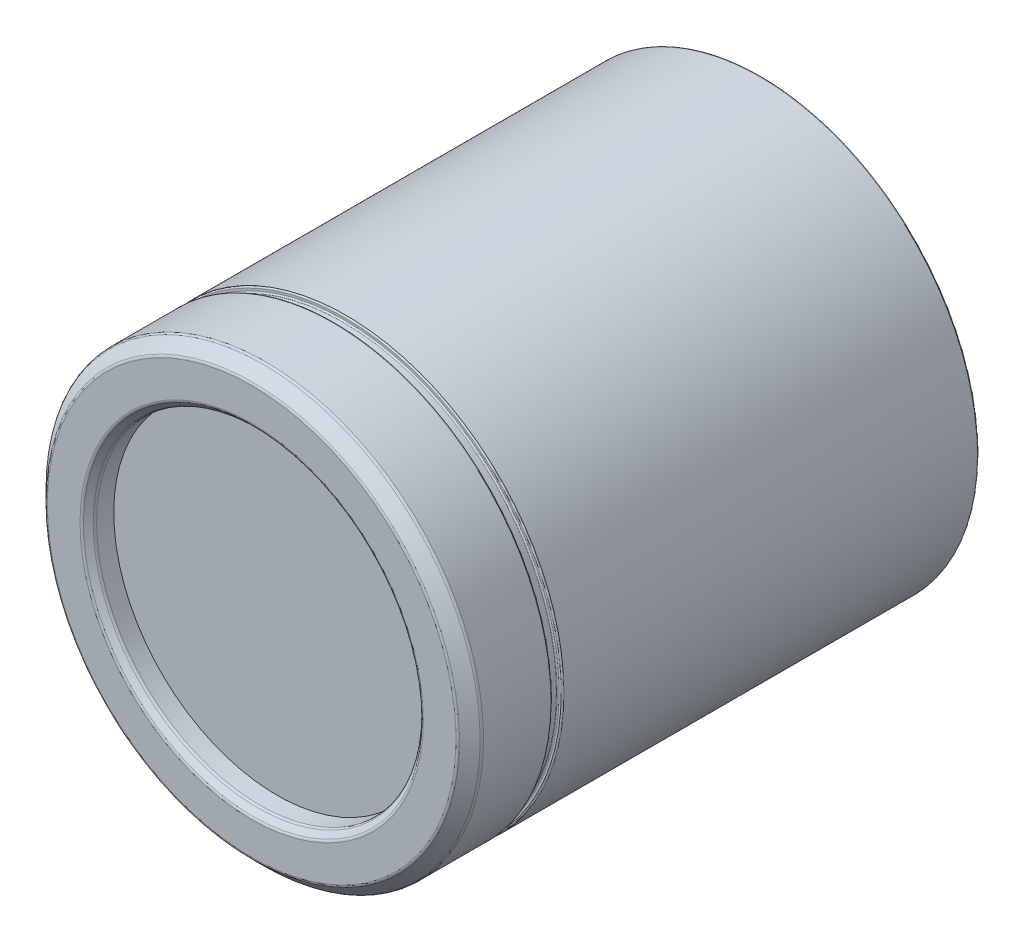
ISO-10303-21;
HEADER;
FILE_DESCRIPTION(('STEP AP214'),'2;1');
FILE_NAME('part.step','',(''),(''),'','','');
FILE_SCHEMA(('AUTOMOTIVE_DESIGN { 1 0 10303 214 1 1 1 1 }'));
ENDSEC;
DATA;
#1=APPLICATION_CONTEXT('core data for automotive mechanical design processes');
#2=APPLICATION_PROTOCOL_DEFINITION('international standard','automotive_design',2000,#1);
#3=PRODUCT_CONTEXT('',#1,'mechanical');
#4=PRODUCT('Part','Part','',(#3));
#5=PRODUCT_RELATED_PRODUCT_CATEGORY('part','',(#4));
#6=PRODUCT_DEFINITION_FORMATION('','',#4);
#7=PRODUCT_DEFINITION_CONTEXT('part definition',#1,'design');
#8=PRODUCT_DEFINITION('design','',#6,#7);
#9=PRODUCT_DEFINITION_SHAPE('','',#8);
#10=(LENGTH_UNIT() NAMED_UNIT(*) SI_UNIT(.MILLI.,.METRE.));
#11=(NAMED_UNIT(*) PLANE_ANGLE_UNIT() SI_UNIT($,.RADIAN.));
#12=(NAMED_UNIT(*) SI_UNIT($,.STERADIAN.) SOLID_ANGLE_UNIT());
#13=UNCERTAINTY_MEASURE_WITH_UNIT(LENGTH_MEASURE(1.E-05),#10,'distance_accuracy_value','');
#14=(GEOMETRIC_REPRESENTATION_CONTEXT(3) GLOBAL_UNCERTAINTY_ASSIGNED_CONTEXT((#13)) GLOBAL_UNIT_ASSIGNED_CONTEXT((#10,
#11,#12)) REPRESENTATION_CONTEXT('',''));
#15=CARTESIAN_POINT('',(0.,0.,0.));
#16=DIRECTION('',(0.,0.,1.));
#17=DIRECTION('',(1.,0.,0.));
#18=AXIS2_PLACEMENT_3D('',#15,#16,#17);
#19=CARTESIAN_POINT('',(0.,0.,70.3));
#20=DIRECTION('',(0.,0.,1.));
#21=DIRECTION('',(1.,0.,0.));
#22=AXIS2_PLACEMENT_3D('',#19,#20,#21);
#23=PLANE('',#22);
#24=CARTESIAN_POINT('',(0.,0.,70.3));
#25=DIRECTION('',(0.,0.,1.));
#26=DIRECTION('',(1.,0.,0.));
#27=AXIS2_PLACEMENT_3D('',#24,#25,#26);
#28=CIRCLE('',#27,23.75);
#29=CARTESIAN_POINT('',(23.75,0.,70.3));
#30=VERTEX_POINT('',#29);
#31=EDGE_CURVE('E21',#30,#30,#28,.T.);
#32=ORIENTED_EDGE('',*,*,#31,.T.);
#33=EDGE_LOOP('',(#32));
#34=FACE_BOUND('',#33,.T.);
#35=ADVANCED_FACE('F17',(#34),#23,.T.);
#36=CARTESIAN_POINT('',(0.,0.,0.));
#37=DIRECTION('',(0.,0.,1.));
#38=DIRECTION('',(1.,0.,0.));
#39=AXIS2_PLACEMENT_3D('',#36,#37,#38);
#40=CYLINDRICAL_SURFACE('',#39,23.75);
#41=ORIENTED_EDGE('',*,*,#31,.F.);
#42=EDGE_LOOP('',(#41));
#43=FACE_BOUND('',#42,.T.);
#44=CARTESIAN_POINT('',(0.,0.,72.7928932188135));
#45=DIRECTION('',(0.,0.,-1.));
#46=DIRECTION('',(-1.,0.,0.));
#47=AXIS2_PLACEMENT_3D('',#44,#45,#46);
#48=CIRCLE('',#47,23.75);
#49=CARTESIAN_POINT('',(-23.75,0.,72.7928932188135));
#50=VERTEX_POINT('',#49);
#51=EDGE_CURVE('E133',#50,#50,#48,.T.);
#52=ORIENTED_EDGE('',*,*,#51,.F.);
#53=EDGE_LOOP('',(#52));
#54=FACE_BOUND('',#53,.T.);
#55=ADVANCED_FACE('F642',(#43,#54),#40,.F.);
#56=CARTESIAN_POINT('',(0.,0.,72.7928932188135));
#57=DIRECTION('',(0.,0.,-1.));
#58=DIRECTION('',(-1.,0.,0.));
#59=AXIS2_PLACEMENT_3D('',#56,#57,#58);
#60=TOROIDAL_SURFACE('',#59,24.25,0.499999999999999);
#61=CARTESIAN_POINT('',(0.,0.,73.1464466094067));
#62=DIRECTION('',(0.,0.,1.));
#63=DIRECTION('',(1.,0.,0.));
#64=AXIS2_PLACEMENT_3D('',#61,#62,#63);
#65=CIRCLE('',#64,23.8964466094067);
#66=CARTESIAN_POINT('',(23.8964466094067,0.,73.1464466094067));
#67=VERTEX_POINT('',#66);
#68=EDGE_CURVE('E130',#67,#67,#65,.T.);
#69=ORIENTED_EDGE('',*,*,#68,.T.);
#70=EDGE_LOOP('',(#69));
#71=FACE_BOUND('',#70,.T.);
#72=ORIENTED_EDGE('',*,*,#51,.T.);
#73=EDGE_LOOP('',(#72));
#74=FACE_BOUND('',#73,.T.);
#75=ADVANCED_FACE('F359',(#71,#74),#60,.T.);
#76=CARTESIAN_POINT('',(0.,0.,73.8535533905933));
#77=DIRECTION('',(0.,0.,1.));
#78=DIRECTION('',(1.,0.,0.));
#79=AXIS2_PLACEMENT_3D('',#76,#77,#78);
#80=CONICAL_SURFACE('',#79,24.6035533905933,0.785398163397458);
#81=ORIENTED_EDGE('',*,*,#68,.F.);
#82=EDGE_LOOP('',(#81));
#83=FACE_BOUND('',#82,.T.);
#84=CARTESIAN_POINT('',(0.,0.,73.8535533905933));
#85=DIRECTION('',(0.,0.,-1.));
#86=DIRECTION('',(1.,0.,0.));
#87=AXIS2_PLACEMENT_3D('',#84,#85,#86);
#88=CIRCLE('',#87,24.6035533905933);
#89=CARTESIAN_POINT('',(24.6035533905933,0.,73.8535533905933));
#90=VERTEX_POINT('',#89);
#91=EDGE_CURVE('E126',#90,#90,#88,.T.);
#92=ORIENTED_EDGE('',*,*,#91,.F.);
#93=EDGE_LOOP('',(#92));
#94=FACE_BOUND('',#93,.T.);
#95=ADVANCED_FACE('F350',(#83,#94),#80,.F.);
#96=CARTESIAN_POINT('',(0.,0.,73.5000000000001));
#97=DIRECTION('',(0.,0.,1.));
#98=DIRECTION('',(0.,-1.,0.));
#99=AXIS2_PLACEMENT_3D('',#96,#97,#98);
#100=TOROIDAL_SURFACE('',#99,24.9571067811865,0.499999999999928);
#101=ORIENTED_EDGE('',*,*,#91,.T.);
#102=EDGE_LOOP('',(#101));
#103=FACE_BOUND('',#102,.T.);
#104=CARTESIAN_POINT('',(0.,0.,74.));
#105=DIRECTION('',(0.,0.,1.));
#106=DIRECTION('',(0.,-1.,0.));
#107=AXIS2_PLACEMENT_3D('',#104,#105,#106);
#108=CIRCLE('',#107,24.9571067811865);
#109=CARTESIAN_POINT('',(0.,-24.9571067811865,74.));
#110=VERTEX_POINT('',#109);
#111=EDGE_CURVE('E129',#110,#110,#108,.F.);
#112=ORIENTED_EDGE('',*,*,#111,.F.);
#113=EDGE_LOOP('',(#112));
#114=FACE_BOUND('',#113,.T.);
#115=ADVANCED_FACE('F347',(#103,#114),#100,.T.);
#116=CARTESIAN_POINT('',(0.,0.,68.3));
#117=DIRECTION('',(0.,0.,1.));
#118=DIRECTION('',(1.,0.,0.));
#119=AXIS2_PLACEMENT_3D('',#116,#117,#118);
#120=PLANE('',#119);
#121=CARTESIAN_POINT('',(0.,0.,68.3));
#122=DIRECTION('',(0.,0.,-1.));
#123=DIRECTION('',(-1.,0.,0.));
#124=AXIS2_PLACEMENT_3D('',#121,#122,#123);
#125=CIRCLE('',#124,24.75);
#126=CARTESIAN_POINT('',(-24.75,0.,68.3));
#127=VERTEX_POINT('',#126);
#128=EDGE_CURVE('E335',#127,#127,#125,.T.);
#129=ORIENTED_EDGE('',*,*,#128,.T.);
#130=EDGE_LOOP('',(#129));
#131=FACE_BOUND('',#130,.T.);
#132=ADVANCED_FACE('F349',(#131),#120,.F.);
#133=CARTESIAN_POINT('',(0.,0.,74.));
#134=DIRECTION('',(0.,0.,1.));
#135=DIRECTION('',(1.,0.,0.));
#136=AXIS2_PLACEMENT_3D('',#133,#134,#135);
#137=PLANE('',#136);
#138=ORIENTED_EDGE('',*,*,#111,.T.);
#139=EDGE_LOOP('',(#138));
#140=FACE_BOUND('',#139,.T.);
#141=CARTESIAN_POINT('',(0.,0.,74.));
#142=DIRECTION('',(0.,0.,1.));
#143=DIRECTION('',(0.,-1.,0.));
#144=AXIS2_PLACEMENT_3D('',#141,#142,#143);
#145=CIRCLE('',#144,29.6928932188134);
#146=CARTESIAN_POINT('',(0.,-29.6928932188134,74.));
#147=VERTEX_POINT('',#146);
#148=EDGE_CURVE('E332',#147,#147,#145,.F.);
#149=ORIENTED_EDGE('',*,*,#148,.F.);
#150=EDGE_LOOP('',(#149));
#151=FACE_BOUND('',#150,.T.);
#152=ADVANCED_FACE('F344',(#140,#151),#137,.T.);
#153=CARTESIAN_POINT('',(0.,0.,66.));
#154=DIRECTION('',(0.,0.,1.));
#155=DIRECTION('',(1.,0.,0.));
#156=AXIS2_PLACEMENT_3D('',#153,#154,#155);
#157=PLANE('',#156);
#158=CARTESIAN_POINT('',(-25.5,0.,65.9999999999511));
#159=DIRECTION('',(0.,0.,-1.));
#160=DIRECTION('',(-1.,0.,0.));
#161=AXIS2_PLACEMENT_3D('',#158,#159,#160);
#162=CIRCLE('',#161,0.551575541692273);
#163=CARTESIAN_POINT('',(-25.5,-0.551575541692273,65.9999999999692));
#164=VERTEX_POINT('',#163);
#165=CARTESIAN_POINT('',(-25.5,0.551575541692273,65.9999999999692));
#166=VERTEX_POINT('',#165);
#167=EDGE_CURVE('E96',#164,#166,#162,.T.);
#168=ORIENTED_EDGE('',*,*,#167,.T.);
#169=CARTESIAN_POINT('',(-25.5,0.,65.9999999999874));
#170=DIRECTION('',(0.,0.,-1.));
#171=DIRECTION('',(-1.,0.,0.));
#172=AXIS2_PLACEMENT_3D('',#169,#170,#171);
#173=CIRCLE('',#172,0.551575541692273);
#174=EDGE_CURVE('E62',#166,#164,#173,.T.);
#175=ORIENTED_EDGE('',*,*,#174,.T.);
#176=EDGE_LOOP('',(#168,#175));
#177=FACE_BOUND('',#176,.T.);
#178=ADVANCED_FACE('F602',(#177),#157,.F.);
#179=CARTESIAN_POINT('',(0.,0.,68.3));
#180=DIRECTION('',(0.,0.,-1.));
#181=DIRECTION('',(-1.,0.,0.));
#182=AXIS2_PLACEMENT_3D('',#179,#180,#181);
#183=CYLINDRICAL_SURFACE('',#182,24.75);
#184=CARTESIAN_POINT('',(0.,0.,67.3));
#185=DIRECTION('',(0.,0.,-1.));
#186=DIRECTION('',(-1.,0.,0.));
#187=AXIS2_PLACEMENT_3D('',#184,#185,#186);
#188=CIRCLE('',#187,24.75);
#189=CARTESIAN_POINT('',(-24.75,0.,67.3));
#190=VERTEX_POINT('',#189);
#191=EDGE_CURVE('E328',#190,#190,#188,.T.);
#192=ORIENTED_EDGE('',*,*,#191,.T.);
#193=EDGE_LOOP('',(#192));
#194=FACE_BOUND('',#193,.T.);
#195=ORIENTED_EDGE('',*,*,#128,.F.);
#196=EDGE_LOOP('',(#195));
#197=FACE_BOUND('',#196,.T.);
#198=ADVANCED_FACE('F593',(#194,#197),#183,.F.);
#199=CARTESIAN_POINT('',(0.,0.,66.));
#200=DIRECTION('',(0.,0.,1.));
#201=DIRECTION('',(1.,0.,0.));
#202=AXIS2_PLACEMENT_3D('',#199,#200,#201);
#203=PLANE('',#202);
#204=CARTESIAN_POINT('',(25.5,0.,65.9999999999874));
#205=DIRECTION('',(0.,0.,-1.));
#206=DIRECTION('',(-1.,0.,0.));
#207=AXIS2_PLACEMENT_3D('',#204,#205,#206);
#208=CIRCLE('',#207,0.551575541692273);
#209=CARTESIAN_POINT('',(25.5,-0.551575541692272,65.9999999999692));
#210=VERTEX_POINT('',#209);
#211=CARTESIAN_POINT('',(25.5,0.551575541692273,65.9999999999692));
#212=VERTEX_POINT('',#211);
#213=EDGE_CURVE('E105',#210,#212,#208,.T.);
#214=ORIENTED_EDGE('',*,*,#213,.T.);
#215=CARTESIAN_POINT('',(25.5,0.,65.9999999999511));
#216=DIRECTION('',(0.,0.,-1.));
#217=DIRECTION('',(-1.,0.,0.));
#218=AXIS2_PLACEMENT_3D('',#215,#216,#217);
#219=CIRCLE('',#218,0.551575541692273);
#220=EDGE_CURVE('E319',#212,#210,#219,.T.);
#221=ORIENTED_EDGE('',*,*,#220,.T.);
#222=EDGE_LOOP('',(#214,#221));
#223=FACE_BOUND('',#222,.T.);
#224=ADVANCED_FACE('F367',(#223),#203,.F.);
#225=CARTESIAN_POINT('',(0.,0.,73.5));
#226=DIRECTION('',(0.,0.,1.));
#227=DIRECTION('',(0.,-1.,0.));
#228=AXIS2_PLACEMENT_3D('',#225,#226,#227);
#229=TOROIDAL_SURFACE('',#228,29.6928932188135,0.499999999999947);
#230=ORIENTED_EDGE('',*,*,#148,.T.);
#231=EDGE_LOOP('',(#230));
#232=FACE_BOUND('',#231,.T.);
#233=CARTESIAN_POINT('',(0.,0.,73.8535533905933));
#234=DIRECTION('',(0.,0.,-1.));
#235=DIRECTION('',(-1.,0.,0.));
#236=AXIS2_PLACEMENT_3D('',#233,#234,#235);
#237=CIRCLE('',#236,30.0464466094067);
#238=CARTESIAN_POINT('',(-30.0464466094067,0.,73.8535533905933));
#239=VERTEX_POINT('',#238);
#240=EDGE_CURVE('E108',#239,#239,#237,.T.);
#241=ORIENTED_EDGE('',*,*,#240,.F.);
#242=EDGE_LOOP('',(#241));
#243=FACE_BOUND('',#242,.T.);
#244=ADVANCED_FACE('F365',(#232,#243),#229,.T.);
#245=CARTESIAN_POINT('',(-25.5,0.,65.3400000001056));
#246=DIRECTION('',(0.,0.,-1.));
#247=DIRECTION('',(-1.,0.,0.));
#248=AXIS2_PLACEMENT_3D('',#245,#246,#247);
#249=CONICAL_SURFACE('',#248,1.64999999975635,1.02974425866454);
#250=DIRECTION('',(0.,0.857167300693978,0.515038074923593));
#251=VECTOR('',#250,1.);
#252=CARTESIAN_POINT('',(-25.4999999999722,-499000.,-299763.117485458));
#253=LINE('',#252,#251);
#254=CARTESIAN_POINT('',(-25.5,-1.64999999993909,65.3400000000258));
#255=VERTEX_POINT('',#254);
#256=EDGE_CURVE('E91',#164,#255,#253,.F.);
#257=ORIENTED_EDGE('',*,*,#256,.T.);
#258=CARTESIAN_POINT('',(-25.5,0.,65.34));
#259=DIRECTION('',(0.,0.,-1.));
#260=DIRECTION('',(-1.,0.,0.));
#261=AXIS2_PLACEMENT_3D('',#258,#259,#260);
#262=CIRCLE('',#261,1.65);
#263=CARTESIAN_POINT('',(-25.5,1.64999999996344,65.339999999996));
#264=VERTEX_POINT('',#263);
#265=EDGE_CURVE('E95',#255,#264,#262,.T.);
#266=ORIENTED_EDGE('',*,*,#265,.T.);
#267=DIRECTION('',(0.,-0.857167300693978,0.515038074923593));
#268=VECTOR('',#267,1.);
#269=CARTESIAN_POINT('',(-25.5,499000.,-299763.117485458));
#270=LINE('',#269,#268);
#271=EDGE_CURVE('E122',#264,#166,#270,.T.);
#272=ORIENTED_EDGE('',*,*,#271,.T.);
#273=ORIENTED_EDGE('',*,*,#167,.F.);
#274=EDGE_LOOP('',(#257,#266,#272,#273));
#275=FACE_BOUND('',#274,.T.);
#276=ADVANCED_FACE('F93',(#275),#249,.F.);
#277=CARTESIAN_POINT('',(-25.5,0.,65.3400000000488));
#278=DIRECTION('',(0.,0.,-1.));
#279=DIRECTION('',(-1.,0.,0.));
#280=AXIS2_PLACEMENT_3D('',#277,#278,#279);
#281=CONICAL_SURFACE('',#280,1.64999999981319,1.02974425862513);
#282=ORIENTED_EDGE('',*,*,#174,.F.);
#283=ORIENTED_EDGE('',*,*,#271,.F.);
#284=CARTESIAN_POINT('',(-25.5,0.,65.3399999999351));
#285=DIRECTION('',(0.,0.,-1.));
#286=DIRECTION('',(0.,1.,0.));
#287=AXIS2_PLACEMENT_3D('',#284,#285,#286);
#288=CIRCLE('',#287,1.65000000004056);
#289=CARTESIAN_POINT('',(-24.4662254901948,1.28600554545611,65.3399999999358));
#290=VERTEX_POINT('',#289);
#291=EDGE_CURVE('E74',#290,#264,#288,.F.);
#292=ORIENTED_EDGE('',*,*,#291,.F.);
#293=CARTESIAN_POINT('',(-24.4662254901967,1.28600554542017,65.3399999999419));
#294=CARTESIAN_POINT('',(-24.4680216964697,1.25183126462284,65.356677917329));
#295=CARTESIAN_POINT('',(-24.4697513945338,1.21755952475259,65.3731629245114));
#296=CARTESIAN_POINT('',(-24.4730767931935,1.14878131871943,65.4056628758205));
#297=CARTESIAN_POINT('',(-24.4746724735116,1.11427481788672,65.4216777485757));
#298=CARTESIAN_POINT('',(-24.4792677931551,1.010096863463,65.4690023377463));
#299=CARTESIAN_POINT('',(-24.4820620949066,0.940025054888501,65.4994644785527));
#300=CARTESIAN_POINT('',(-24.4871502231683,0.796709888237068,65.5577904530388));
#301=CARTESIAN_POINT('',(-24.4894296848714,0.723431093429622,65.5855696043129));
#302=CARTESIAN_POINT('',(-24.4933614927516,0.575094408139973,65.6357934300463));
#303=CARTESIAN_POINT('',(-24.4950147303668,0.500039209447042,65.6582456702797));
#304=CARTESIAN_POINT('',(-24.4972073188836,0.373359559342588,65.6890734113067));
#305=CARTESIAN_POINT('',(-24.4979342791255,0.322281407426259,65.6996458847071));
#306=CARTESIAN_POINT('',(-24.4990715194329,0.219403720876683,65.7164397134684));
#307=CARTESIAN_POINT('',(-24.4994818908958,0.167604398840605,65.7226623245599));
#308=CARTESIAN_POINT('',(-24.4999696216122,0.0642401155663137,65.7300817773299));
#309=CARTESIAN_POINT('',(-24.500050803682,0.0126794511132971,65.7313363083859));
#310=CARTESIAN_POINT('',(-24.4998876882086,-0.0903183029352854,65.7288404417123));
#311=CARTESIAN_POINT('',(-24.4996433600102,-0.141755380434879,65.725089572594));
#312=CARTESIAN_POINT('',(-24.4987021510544,-0.261272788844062,65.7109393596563));
#313=CARTESIAN_POINT('',(-24.4978807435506,-0.329134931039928,65.698728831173));
#314=CARTESIAN_POINT('',(-24.4957096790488,-0.463391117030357,65.6678977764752));
#315=CARTESIAN_POINT('',(-24.494359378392,-0.529783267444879,65.6492694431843));
#316=CARTESIAN_POINT('',(-24.4911490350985,-0.661840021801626,65.6072304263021));
#317=CARTESIAN_POINT('',(-24.489283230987,-0.727487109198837,65.5837664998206));
#318=CARTESIAN_POINT('',(-24.4850761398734,-0.857481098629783,65.5336413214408));
#319=CARTESIAN_POINT('',(-24.4827350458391,-0.921828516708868,65.506981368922));
#320=CARTESIAN_POINT('',(-24.4781144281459,-1.03658575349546,65.4570650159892));
#321=CARTESIAN_POINT('',(-24.4759185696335,-1.08717746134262,65.4342137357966));
#322=CARTESIAN_POINT('',(-24.4712673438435,-1.18724370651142,65.3876932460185));
#323=CARTESIAN_POINT('',(-24.4688153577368,-1.2367243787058,65.3640369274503));
#324=CARTESIAN_POINT('',(-24.4662254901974,-1.28600554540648,65.3399999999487));
#325=B_SPLINE_CURVE_WITH_KNOTS('',3,(#293,#294,#295,#296,#297,#298,#299,#300,#301,#302,#303,
#304,#305,#306,#307,#308,#309,#310,#311,#312,#313,#314,#315,#316,#317,#318,#319,#320,#321,#322,
#323,#324),.UNSPECIFIED.,.F.,.F.,(4,2,2,2,2,2,2,2,2,2,2,2,2,2,2,4),(0.,0.11420578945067,
0.228428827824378,0.45773920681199,0.692820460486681,0.927565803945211,1.08391225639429,
1.24021355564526,1.39469446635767,1.54918992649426,1.75562413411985,1.96231035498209,
2.17140716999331,2.38041926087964,2.54707490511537,2.71175694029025),.UNSPECIFIED.);
#326=CARTESIAN_POINT('',(-24.4662254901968,-1.28600554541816,65.339999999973));
#327=VERTEX_POINT('',#326);
#328=EDGE_CURVE('E102',#290,#327,#325,.T.);
#329=ORIENTED_EDGE('',*,*,#328,.T.);
#330=CARTESIAN_POINT('',(-25.5,0.,65.3399999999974));
#331=DIRECTION('',(0.,0.,-1.));
#332=DIRECTION('',(-1.,0.,0.));
#333=AXIS2_PLACEMENT_3D('',#330,#331,#332);
#334=CIRCLE('',#333,1.65);
#335=EDGE_CURVE('E97',#327,#255,#334,.T.);
#336=ORIENTED_EDGE('',*,*,#335,.T.);
#337=ORIENTED_EDGE('',*,*,#256,.F.);
#338=EDGE_LOOP('',(#282,#283,#292,#329,#336,#337));
#339=FACE_BOUND('',#338,.T.);
#340=ADVANCED_FACE('F100',(#339),#281,.F.);
#341=CARTESIAN_POINT('',(25.5,0.,65.3400000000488));
#342=DIRECTION('',(0.,0.,-1.));
#343=DIRECTION('',(-1.,0.,0.));
#344=AXIS2_PLACEMENT_3D('',#341,#342,#343);
#345=CONICAL_SURFACE('',#344,1.64999999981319,1.02974425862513);
#346=DIRECTION('',(0.,0.857167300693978,0.515038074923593));
#347=VECTOR('',#346,1.);
#348=CARTESIAN_POINT('',(25.5000000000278,-499000.,-299763.117485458));
#349=LINE('',#348,#347);
#350=CARTESIAN_POINT('',(25.5,-1.64999999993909,65.3400000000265));
#351=VERTEX_POINT('',#350);
#352=EDGE_CURVE('E310',#210,#351,#349,.F.);
#353=ORIENTED_EDGE('',*,*,#352,.T.);
#354=CARTESIAN_POINT('',(25.5,0.,65.34));
#355=DIRECTION('',(0.,0.,-1.));
#356=DIRECTION('',(-1.,0.,0.));
#357=AXIS2_PLACEMENT_3D('',#354,#355,#356);
#358=CIRCLE('',#357,1.65);
#359=CARTESIAN_POINT('',(24.4662254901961,-1.28600554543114,65.3399999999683));
#360=VERTEX_POINT('',#359);
#361=EDGE_CURVE('E112',#351,#360,#358,.T.);
#362=ORIENTED_EDGE('',*,*,#361,.T.);
#363=CARTESIAN_POINT('',(24.4662254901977,-1.28600554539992,65.3399999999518));
#364=CARTESIAN_POINT('',(24.4680216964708,-1.25183126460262,65.3566779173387));
#365=CARTESIAN_POINT('',(24.4697513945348,-1.2175595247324,65.3731629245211));
#366=CARTESIAN_POINT('',(24.4730767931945,-1.14878131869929,65.4056628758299));
#367=CARTESIAN_POINT('',(24.4746724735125,-1.1142748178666,65.4216777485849));
#368=CARTESIAN_POINT('',(24.479267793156,-1.01009686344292,65.4690023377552));
#369=CARTESIAN_POINT('',(24.4820620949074,-0.94002505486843,65.4994644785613));
#370=CARTESIAN_POINT('',(24.4871502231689,-0.796709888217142,65.5577904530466));
#371=CARTESIAN_POINT('',(24.489429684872,-0.723431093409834,65.5855696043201));
#372=CARTESIAN_POINT('',(24.493361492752,-0.575094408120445,65.6357934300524));
#373=CARTESIAN_POINT('',(24.4950147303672,-0.500039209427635,65.6582456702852));
#374=CARTESIAN_POINT('',(24.4972073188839,-0.373359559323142,65.6890734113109));
#375=CARTESIAN_POINT('',(24.4979342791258,-0.322281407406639,65.6996458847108));
#376=CARTESIAN_POINT('',(24.4990715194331,-0.21940372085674,65.716439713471));
#377=CARTESIAN_POINT('',(24.4994818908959,-0.167604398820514,65.722662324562));
#378=CARTESIAN_POINT('',(24.4999696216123,-0.0642401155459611,65.7300817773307));
#379=CARTESIAN_POINT('',(24.500050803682,-0.0126794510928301,65.731336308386));
#380=CARTESIAN_POINT('',(24.4998876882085,0.0903183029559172,65.7288404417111));
#381=CARTESIAN_POINT('',(24.4996433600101,0.141755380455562,65.7250895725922));
#382=CARTESIAN_POINT('',(24.4987021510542,0.261272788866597,65.7109393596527));
#383=CARTESIAN_POINT('',(24.4978807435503,0.32913493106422,65.6987288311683));
#384=CARTESIAN_POINT('',(24.4957096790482,0.463391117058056,65.667897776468));
#385=CARTESIAN_POINT('',(24.4943593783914,0.529783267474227,65.6492694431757));
#386=CARTESIAN_POINT('',(24.4911490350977,0.661840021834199,65.6072304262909));
#387=CARTESIAN_POINT('',(24.489283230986,0.727487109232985,65.5837664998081));
#388=CARTESIAN_POINT('',(24.4850761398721,0.857481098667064,65.5336413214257));
#389=CARTESIAN_POINT('',(24.4827350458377,0.921828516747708,65.5069813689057));
#390=CARTESIAN_POINT('',(24.4781144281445,1.03658575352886,65.4570650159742));
#391=CARTESIAN_POINT('',(24.4759185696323,1.08717746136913,65.4342137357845));
#392=CARTESIAN_POINT('',(24.4712673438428,1.18724370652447,65.3876932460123));
#393=CARTESIAN_POINT('',(24.4688153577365,1.23672437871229,65.3640369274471));
#394=CARTESIAN_POINT('',(24.4662254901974,1.28600554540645,65.3399999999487));
#395=B_SPLINE_CURVE_WITH_KNOTS('',3,(#363,#364,#365,#366,#367,#368,#369,#370,#371,#372,#373,
#374,#375,#376,#377,#378,#379,#380,#381,#382,#383,#384,#385,#386,#387,#388,#389,#390,#391,#392,
#393,#394),.UNSPECIFIED.,.F.,.F.,(4,2,2,2,2,2,2,2,2,2,2,2,2,2,2,4),(0.,0.114205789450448,
0.228428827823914,0.457739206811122,0.692820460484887,0.927565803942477,1.08391225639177,
1.24021355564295,1.39469446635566,1.54918992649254,1.75562413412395,1.96231035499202,
2.17140717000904,2.38041926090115,2.54707490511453,2.71175694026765),.UNSPECIFIED.);
#396=CARTESIAN_POINT('',(24.4662254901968,1.28600554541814,65.339999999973));
#397=VERTEX_POINT('',#396);
#398=EDGE_CURVE('E178',#360,#397,#395,.T.);
#399=ORIENTED_EDGE('',*,*,#398,.T.);
#400=CARTESIAN_POINT('',(25.5,0.,65.3399999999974));
#401=DIRECTION('',(0.,0.,-1.));
#402=DIRECTION('',(-1.,0.,0.));
#403=AXIS2_PLACEMENT_3D('',#400,#401,#402);
#404=CIRCLE('',#403,1.65);
#405=CARTESIAN_POINT('',(25.5,1.64999999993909,65.3400000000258));
#406=VERTEX_POINT('',#405);
#407=EDGE_CURVE('E297',#397,#406,#404,.T.);
#408=ORIENTED_EDGE('',*,*,#407,.T.);
#409=DIRECTION('',(0.,-0.857167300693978,0.515038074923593));
#410=VECTOR('',#409,1.);
#411=CARTESIAN_POINT('',(25.5,499000.,-299763.117485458));
#412=LINE('',#411,#410);
#413=EDGE_CURVE('E322',#406,#212,#412,.T.);
#414=ORIENTED_EDGE('',*,*,#413,.T.);
#415=ORIENTED_EDGE('',*,*,#213,.F.);
#416=EDGE_LOOP('',(#353,#362,#399,#408,#414,#415));
#417=FACE_BOUND('',#416,.T.);
#418=ADVANCED_FACE('F193',(#417),#345,.F.);
#419=CARTESIAN_POINT('',(0.,0.,67.3000000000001));
#420=DIRECTION('',(0.,0.,-1.));
#421=DIRECTION('',(-1.,0.,0.));
#422=AXIS2_PLACEMENT_3D('',#419,#420,#421);
#423=PLANE('',#422);
#424=ORIENTED_EDGE('',*,*,#191,.F.);
#425=EDGE_LOOP('',(#424));
#426=FACE_BOUND('',#425,.T.);
#427=CARTESIAN_POINT('',(0.,0.,67.3000000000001));
#428=DIRECTION('',(0.,0.,-1.));
#429=DIRECTION('',(-1.,0.,0.));
#430=AXIS2_PLACEMENT_3D('',#427,#428,#429);
#431=CIRCLE('',#430,24.5);
#432=CARTESIAN_POINT('',(-24.5,0.,67.3000000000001));
#433=VERTEX_POINT('',#432);
#434=EDGE_CURVE('E173',#433,#433,#431,.T.);
#435=ORIENTED_EDGE('',*,*,#434,.T.);
#436=EDGE_LOOP('',(#435));
#437=FACE_BOUND('',#436,.T.);
#438=ADVANCED_FACE('F213',(#426,#437),#423,.F.);
#439=CARTESIAN_POINT('',(25.5,0.,65.3400000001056));
#440=DIRECTION('',(0.,0.,-1.));
#441=DIRECTION('',(-1.,0.,0.));
#442=AXIS2_PLACEMENT_3D('',#439,#440,#441);
#443=CONICAL_SURFACE('',#442,1.64999999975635,1.02974425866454);
#444=ORIENTED_EDGE('',*,*,#220,.F.);
#445=ORIENTED_EDGE('',*,*,#413,.F.);
#446=CARTESIAN_POINT('',(25.5,0.,65.34));
#447=DIRECTION('',(0.,0.,-1.));
#448=DIRECTION('',(-1.,0.,0.));
#449=AXIS2_PLACEMENT_3D('',#446,#447,#448);
#450=CIRCLE('',#449,1.65);
#451=EDGE_CURVE('E176',#406,#351,#450,.T.);
#452=ORIENTED_EDGE('',*,*,#451,.T.);
#453=ORIENTED_EDGE('',*,*,#352,.F.);
#454=EDGE_LOOP('',(#444,#445,#452,#453));
#455=FACE_BOUND('',#454,.T.);
#456=ADVANCED_FACE('F210',(#455),#443,.F.);
#457=CARTESIAN_POINT('',(0.,0.,72.3464466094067));
#458=DIRECTION('',(0.,0.,-1.));
#459=DIRECTION('',(-1.,0.,0.));
#460=AXIS2_PLACEMENT_3D('',#457,#458,#459);
#461=CONICAL_SURFACE('',#460,31.5535533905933,0.785398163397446);
#462=CARTESIAN_POINT('',(0.,0.,72.3464466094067));
#463=DIRECTION('',(0.,0.,-1.));
#464=DIRECTION('',(1.,0.,0.));
#465=AXIS2_PLACEMENT_3D('',#462,#463,#464);
#466=CIRCLE('',#465,31.5535533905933);
#467=CARTESIAN_POINT('',(31.5535533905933,0.,72.3464466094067));
#468=VERTEX_POINT('',#467);
#469=EDGE_CURVE('E172',#468,#468,#466,.T.);
#470=ORIENTED_EDGE('',*,*,#469,.F.);
#471=EDGE_LOOP('',(#470));
#472=FACE_BOUND('',#471,.T.);
#473=ORIENTED_EDGE('',*,*,#240,.T.);
#474=EDGE_LOOP('',(#473));
#475=FACE_BOUND('',#474,.T.);
#476=ADVANCED_FACE('F207',(#472,#475),#461,.T.);
#477=CARTESIAN_POINT('',(-25.5,0.,61.3000000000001));
#478=DIRECTION('',(0.,0.,-1.));
#479=DIRECTION('',(-1.,0.,0.));
#480=AXIS2_PLACEMENT_3D('',#477,#478,#479);
#481=CYLINDRICAL_SURFACE('',#480,1.65);
#482=ORIENTED_EDGE('',*,*,#265,.F.);
#483=ORIENTED_EDGE('',*,*,#335,.F.);
#484=DIRECTION('',(0.,0.,-1.));
#485=VECTOR('',#484,1.);
#486=CARTESIAN_POINT('',(-24.4662254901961,-1.28600554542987,67.3000000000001));
#487=LINE('',#486,#485);
#488=CARTESIAN_POINT('',(-24.4662254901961,-1.28600554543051,61.3000000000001));
#489=VERTEX_POINT('',#488);
#490=EDGE_CURVE('E305',#327,#489,#487,.T.);
#491=ORIENTED_EDGE('',*,*,#490,.T.);
#492=CARTESIAN_POINT('',(-25.5,0.,61.3000000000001));
#493=DIRECTION('',(0.,0.,-1.));
#494=DIRECTION('',(-1.,0.,0.));
#495=AXIS2_PLACEMENT_3D('',#492,#493,#494);
#496=CIRCLE('',#495,1.65);
#497=CARTESIAN_POINT('',(-24.4662254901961,1.28600554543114,61.3000000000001));
#498=VERTEX_POINT('',#497);
#499=EDGE_CURVE('E167',#498,#489,#496,.F.);
#500=ORIENTED_EDGE('',*,*,#499,.F.);
#501=DIRECTION('',(0.,0.,-1.));
#502=VECTOR('',#501,1.);
#503=CARTESIAN_POINT('',(-24.4662254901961,1.28600554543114,67.3000000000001));
#504=LINE('',#503,#502);
#505=EDGE_CURVE('E87',#498,#290,#504,.F.);
#506=ORIENTED_EDGE('',*,*,#505,.T.);
#507=ORIENTED_EDGE('',*,*,#291,.T.);
#508=EDGE_LOOP('',(#482,#483,#491,#500,#506,#507));
#509=FACE_BOUND('',#508,.T.);
#510=ADVANCED_FACE('F107',(#509),#481,.F.);
#511=CARTESIAN_POINT('',(0.,0.,67.3000000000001));
#512=DIRECTION('',(0.,0.,-1.));
#513=DIRECTION('',(-1.,0.,0.));
#514=AXIS2_PLACEMENT_3D('',#511,#512,#513);
#515=CYLINDRICAL_SURFACE('',#514,24.5);
#516=ORIENTED_EDGE('',*,*,#434,.F.);
#517=EDGE_LOOP('',(#516));
#518=FACE_BOUND('',#517,.T.);
#519=CARTESIAN_POINT('',(0.,0.,61.3000000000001));
#520=DIRECTION('',(0.,0.,-1.));
#521=DIRECTION('',(-1.,0.,0.));
#522=AXIS2_PLACEMENT_3D('',#519,#520,#521);
#523=CIRCLE('',#522,24.5);
#524=CARTESIAN_POINT('',(24.4662254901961,1.28600554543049,61.3));
#525=VERTEX_POINT('',#524);
#526=EDGE_CURVE('E169',#525,#498,#523,.F.);
#527=ORIENTED_EDGE('',*,*,#526,.F.);
#528=DIRECTION('',(0.,0.,-1.));
#529=VECTOR('',#528,1.);
#530=CARTESIAN_POINT('',(24.4662254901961,1.28600554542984,67.3000000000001));
#531=LINE('',#530,#529);
#532=EDGE_CURVE('E177',#397,#525,#531,.T.);
#533=ORIENTED_EDGE('',*,*,#532,.F.);
#534=ORIENTED_EDGE('',*,*,#398,.F.);
#535=DIRECTION('',(0.,0.,-1.));
#536=VECTOR('',#535,1.);
#537=CARTESIAN_POINT('',(24.4662254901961,-1.28600554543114,67.3000000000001));
#538=LINE('',#537,#536);
#539=CARTESIAN_POINT('',(24.4662254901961,-1.28600554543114,61.3));
#540=VERTEX_POINT('',#539);
#541=EDGE_CURVE('E186',#540,#360,#538,.F.);
#542=ORIENTED_EDGE('',*,*,#541,.F.);
#543=CARTESIAN_POINT('',(0.,0.,61.3000000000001));
#544=DIRECTION('',(0.,0.,-1.));
#545=DIRECTION('',(-1.,0.,0.));
#546=AXIS2_PLACEMENT_3D('',#543,#544,#545);
#547=CIRCLE('',#546,24.5);
#548=EDGE_CURVE('E164',#489,#540,#547,.F.);
#549=ORIENTED_EDGE('',*,*,#548,.F.);
#550=ORIENTED_EDGE('',*,*,#490,.F.);
#551=ORIENTED_EDGE('',*,*,#328,.F.);
#552=ORIENTED_EDGE('',*,*,#505,.F.);
#553=EDGE_LOOP('',(#527,#533,#534,#542,#549,#550,#551,#552));
#554=FACE_BOUND('',#553,.T.);
#555=ADVANCED_FACE('F196',(#518,#554),#515,.F.);
#556=CARTESIAN_POINT('',(25.5,0.,61.3));
#557=DIRECTION('',(0.,0.,-1.));
#558=DIRECTION('',(-1.,0.,0.));
#559=AXIS2_PLACEMENT_3D('',#556,#557,#558);
#560=CYLINDRICAL_SURFACE('',#559,1.65);
#561=ORIENTED_EDGE('',*,*,#451,.F.);
#562=ORIENTED_EDGE('',*,*,#407,.F.);
#563=ORIENTED_EDGE('',*,*,#532,.T.);
#564=CARTESIAN_POINT('',(25.5,0.,61.3));
#565=DIRECTION('',(0.,0.,-1.));
#566=DIRECTION('',(-1.,0.,0.));
#567=AXIS2_PLACEMENT_3D('',#564,#565,#566);
#568=CIRCLE('',#567,1.65);
#569=EDGE_CURVE('E36',#540,#525,#568,.F.);
#570=ORIENTED_EDGE('',*,*,#569,.F.);
#571=ORIENTED_EDGE('',*,*,#541,.T.);
#572=ORIENTED_EDGE('',*,*,#361,.F.);
#573=EDGE_LOOP('',(#561,#562,#563,#570,#571,#572));
#574=FACE_BOUND('',#573,.T.);
#575=ADVANCED_FACE('F201',(#574),#560,.F.);
#576=CARTESIAN_POINT('',(0.,0.,71.9928932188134));
#577=DIRECTION('',(0.,0.,1.));
#578=DIRECTION('',(1.,0.,0.));
#579=AXIS2_PLACEMENT_3D('',#576,#577,#578);
#580=TOROIDAL_SURFACE('',#579,31.2000000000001,0.499999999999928);
#581=ORIENTED_EDGE('',*,*,#469,.T.);
#582=EDGE_LOOP('',(#581));
#583=FACE_BOUND('',#582,.T.);
#584=CARTESIAN_POINT('',(0.,0.,71.9928932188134));
#585=DIRECTION('',(0.,0.,-1.));
#586=DIRECTION('',(-1.,0.,0.));
#587=AXIS2_PLACEMENT_3D('',#584,#585,#586);
#588=CIRCLE('',#587,31.7);
#589=CARTESIAN_POINT('',(-31.7,0.,71.9928932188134));
#590=VERTEX_POINT('',#589);
#591=EDGE_CURVE('E162',#590,#590,#588,.T.);
#592=ORIENTED_EDGE('',*,*,#591,.F.);
#593=EDGE_LOOP('',(#592));
#594=FACE_BOUND('',#593,.T.);
#595=ADVANCED_FACE('F283',(#583,#594),#580,.T.);
#596=CARTESIAN_POINT('',(0.,0.,61.3000000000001));
#597=DIRECTION('',(0.,0.,-1.));
#598=DIRECTION('',(-1.,0.,0.));
#599=AXIS2_PLACEMENT_3D('',#596,#597,#598);
#600=PLANE('',#599);
#601=CARTESIAN_POINT('',(0.,0.,61.3000000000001));
#602=DIRECTION('',(0.,0.,1.));
#603=DIRECTION('',(1.,0.,0.));
#604=AXIS2_PLACEMENT_3D('',#601,#602,#603);
#605=CIRCLE('',#604,28.2);
#606=CARTESIAN_POINT('',(28.2,0.,61.3000000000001));
#607=VERTEX_POINT('',#606);
#608=EDGE_CURVE('E158',#607,#607,#605,.T.);
#609=ORIENTED_EDGE('',*,*,#608,.F.);
#610=EDGE_LOOP('',(#609));
#611=FACE_BOUND('',#610,.T.);
#612=ORIENTED_EDGE('',*,*,#569,.T.);
#613=ORIENTED_EDGE('',*,*,#526,.T.);
#614=ORIENTED_EDGE('',*,*,#499,.T.);
#615=ORIENTED_EDGE('',*,*,#548,.T.);
#616=EDGE_LOOP('',(#612,#613,#614,#615));
#617=FACE_BOUND('',#616,.T.);
#618=ADVANCED_FACE('F280',(#611,#617),#600,.T.);
#619=CARTESIAN_POINT('',(0.,0.,73.5));
#620=DIRECTION('',(0.,0.,-1.));
#621=DIRECTION('',(-1.,0.,0.));
#622=AXIS2_PLACEMENT_3D('',#619,#620,#621);
#623=CYLINDRICAL_SURFACE('',#622,31.7);
#624=CARTESIAN_POINT('',(0.,0.,62.2));
#625=DIRECTION('',(0.,0.,-1.));
#626=DIRECTION('',(1.,0.,0.));
#627=AXIS2_PLACEMENT_3D('',#624,#625,#626);
#628=CIRCLE('',#627,31.7);
#629=CARTESIAN_POINT('',(31.7,0.,62.2));
#630=VERTEX_POINT('',#629);
#631=EDGE_CURVE('E161',#630,#630,#628,.T.);
#632=ORIENTED_EDGE('',*,*,#631,.F.);
#633=EDGE_LOOP('',(#632));
#634=FACE_BOUND('',#633,.T.);
#635=ORIENTED_EDGE('',*,*,#591,.T.);
#636=EDGE_LOOP('',(#635));
#637=FACE_BOUND('',#636,.T.);
#638=ADVANCED_FACE('F277',(#634,#637),#623,.T.);
#639=CARTESIAN_POINT('',(0.,0.,61.925));
#640=DIRECTION('',(0.,0.,1.));
#641=DIRECTION('',(1.,0.,0.));
#642=AXIS2_PLACEMENT_3D('',#639,#640,#641);
#643=CONICAL_SURFACE('',#642,28.825,0.785398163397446);
#644=CARTESIAN_POINT('',(0.,0.,61.925));
#645=DIRECTION('',(0.,0.,-1.));
#646=DIRECTION('',(0.,1.,0.));
#647=AXIS2_PLACEMENT_3D('',#644,#645,#646);
#648=CIRCLE('',#647,28.825);
#649=CARTESIAN_POINT('',(0.,28.825,61.925));
#650=VERTEX_POINT('',#649);
#651=EDGE_CURVE('E157',#650,#650,#648,.T.);
#652=ORIENTED_EDGE('',*,*,#651,.T.);
#653=EDGE_LOOP('',(#652));
#654=FACE_BOUND('',#653,.T.);
#655=ORIENTED_EDGE('',*,*,#608,.T.);
#656=EDGE_LOOP('',(#655));
#657=FACE_BOUND('',#656,.T.);
#658=ADVANCED_FACE('F274',(#654,#657),#643,.T.);
#659=CARTESIAN_POINT('',(0.,0.,62.2));
#660=DIRECTION('',(0.,0.,1.));
#661=DIRECTION('',(0.,-1.,0.));
#662=AXIS2_PLACEMENT_3D('',#659,#660,#661);
#663=TOROIDAL_SURFACE('',#662,31.5,0.199999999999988);
#664=ORIENTED_EDGE('',*,*,#631,.T.);
#665=EDGE_LOOP('',(#664));
#666=FACE_BOUND('',#665,.T.);
#667=CARTESIAN_POINT('',(0.,0.,62.));
#668=DIRECTION('',(0.,0.,1.));
#669=DIRECTION('',(0.,-1.,0.));
#670=AXIS2_PLACEMENT_3D('',#667,#668,#669);
#671=CIRCLE('',#670,31.5);
#672=CARTESIAN_POINT('',(0.,-31.5,62.));
#673=VERTEX_POINT('',#672);
#674=EDGE_CURVE('E154',#673,#673,#671,.T.);
#675=ORIENTED_EDGE('',*,*,#674,.T.);
#676=EDGE_LOOP('',(#675));
#677=FACE_BOUND('',#676,.T.);
#678=ADVANCED_FACE('F272',(#666,#677),#663,.T.);
#679=CARTESIAN_POINT('',(0.,0.,59.3));
#680=DIRECTION('',(0.,0.,-1.));
#681=DIRECTION('',(-1.,0.,0.));
#682=AXIS2_PLACEMENT_3D('',#679,#680,#681);
#683=CONICAL_SURFACE('',#682,29.7,0.321750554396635);
#684=ORIENTED_EDGE('',*,*,#651,.F.);
#685=EDGE_LOOP('',(#684));
#686=FACE_BOUND('',#685,.T.);
#687=CARTESIAN_POINT('',(0.,0.,59.3));
#688=DIRECTION('',(0.,0.,-1.));
#689=DIRECTION('',(-1.,0.,0.));
#690=AXIS2_PLACEMENT_3D('',#687,#688,#689);
#691=CIRCLE('',#690,29.7);
#692=CARTESIAN_POINT('',(-29.7,0.,59.3));
#693=VERTEX_POINT('',#692);
#694=EDGE_CURVE('E153',#693,#693,#691,.T.);
#695=ORIENTED_EDGE('',*,*,#694,.T.);
#696=EDGE_LOOP('',(#695));
#697=FACE_BOUND('',#696,.T.);
#698=ADVANCED_FACE('F268',(#686,#697),#683,.F.);
#699=CARTESIAN_POINT('',(0.,0.,62.));
#700=DIRECTION('',(0.,0.,1.));
#701=DIRECTION('',(1.,0.,0.));
#702=AXIS2_PLACEMENT_3D('',#699,#700,#701);
#703=PLANE('',#702);
#704=CARTESIAN_POINT('',(0.,0.,62.));
#705=DIRECTION('',(0.,0.,1.));
#706=DIRECTION('',(0.,-1.,0.));
#707=AXIS2_PLACEMENT_3D('',#704,#705,#706);
#708=CIRCLE('',#707,31.2);
#709=CARTESIAN_POINT('',(0.,-31.2,62.));
#710=VERTEX_POINT('',#709);
#711=EDGE_CURVE('E149',#710,#710,#708,.T.);
#712=ORIENTED_EDGE('',*,*,#711,.T.);
#713=EDGE_LOOP('',(#712));
#714=FACE_BOUND('',#713,.T.);
#715=ORIENTED_EDGE('',*,*,#674,.F.);
#716=EDGE_LOOP('',(#715));
#717=FACE_BOUND('',#716,.T.);
#718=ADVANCED_FACE('F264',(#714,#717),#703,.F.);
#719=CARTESIAN_POINT('',(0.,0.,70.3));
#720=DIRECTION('',(0.,0.,-1.));
#721=DIRECTION('',(-1.,0.,0.));
#722=AXIS2_PLACEMENT_3D('',#719,#720,#721);
#723=CYLINDRICAL_SURFACE('',#722,29.7);
#724=CARTESIAN_POINT('',(0.,0.,4.57));
#725=DIRECTION('',(0.,0.,-1.));
#726=DIRECTION('',(0.,1.,0.));
#727=AXIS2_PLACEMENT_3D('',#724,#725,#726);
#728=CIRCLE('',#727,29.7);
#729=CARTESIAN_POINT('',(0.,29.7,4.57000000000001));
#730=VERTEX_POINT('',#729);
#731=EDGE_CURVE('E152',#730,#730,#728,.T.);
#732=ORIENTED_EDGE('',*,*,#731,.T.);
#733=EDGE_LOOP('',(#732));
#734=FACE_BOUND('',#733,.T.);
#735=ORIENTED_EDGE('',*,*,#694,.F.);
#736=EDGE_LOOP('',(#735));
#737=FACE_BOUND('',#736,.T.);
#738=ADVANCED_FACE('F261',(#734,#737),#723,.F.);
#739=CARTESIAN_POINT('',(0.,0.,61.8));
#740=DIRECTION('',(0.,0.,1.));
#741=DIRECTION('',(0.,-1.,0.));
#742=AXIS2_PLACEMENT_3D('',#739,#740,#741);
#743=TOROIDAL_SURFACE('',#742,31.2,0.199999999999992);
#744=ORIENTED_EDGE('',*,*,#711,.F.);
#745=EDGE_LOOP('',(#744));
#746=FACE_BOUND('',#745,.T.);
#747=CARTESIAN_POINT('',(0.,0.,61.8));
#748=DIRECTION('',(0.,0.,1.));
#749=DIRECTION('',(1.,0.,0.));
#750=AXIS2_PLACEMENT_3D('',#747,#748,#749);
#751=CIRCLE('',#750,31.);
#752=CARTESIAN_POINT('',(31.,0.,61.8));
#753=VERTEX_POINT('',#752);
#754=EDGE_CURVE('E396',#753,#753,#751,.F.);
#755=ORIENTED_EDGE('',*,*,#754,.F.);
#756=EDGE_LOOP('',(#755));
#757=FACE_BOUND('',#756,.T.);
#758=ADVANCED_FACE('F259',(#746,#757),#743,.F.);
#759=CARTESIAN_POINT('',(0.,0.,3.695));
#760=DIRECTION('',(0.,0.,-1.));
#761=DIRECTION('',(-1.,0.,0.));
#762=AXIS2_PLACEMENT_3D('',#759,#760,#761);
#763=CONICAL_SURFACE('',#762,30.575,0.785398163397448);
#764=ORIENTED_EDGE('',*,*,#731,.F.);
#765=EDGE_LOOP('',(#764));
#766=FACE_BOUND('',#765,.T.);
#767=CARTESIAN_POINT('',(0.,0.,3.69500000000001));
#768=DIRECTION('',(0.,0.,-1.));
#769=DIRECTION('',(-1.,0.,0.));
#770=AXIS2_PLACEMENT_3D('',#767,#768,#769);
#771=CIRCLE('',#770,30.575);
#772=CARTESIAN_POINT('',(-30.575,0.,3.69500000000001));
#773=VERTEX_POINT('',#772);
#774=EDGE_CURVE('E393',#773,#773,#771,.T.);
#775=ORIENTED_EDGE('',*,*,#774,.T.);
#776=EDGE_LOOP('',(#775));
#777=FACE_BOUND('',#776,.T.);
#778=ADVANCED_FACE('F255',(#766,#777),#763,.F.);
#779=CARTESIAN_POINT('',(0.,0.,60.5));
#780=DIRECTION('',(0.,0.,1.));
#781=DIRECTION('',(1.,0.,0.));
#782=AXIS2_PLACEMENT_3D('',#779,#780,#781);
#783=CYLINDRICAL_SURFACE('',#782,31.);
#784=ORIENTED_EDGE('',*,*,#754,.T.);
#785=EDGE_LOOP('',(#784));
#786=FACE_BOUND('',#785,.T.);
#787=CARTESIAN_POINT('',(0.,0.,60.7));
#788=DIRECTION('',(0.,0.,1.));
#789=DIRECTION('',(1.,0.,0.));
#790=AXIS2_PLACEMENT_3D('',#787,#788,#789);
#791=CIRCLE('',#790,31.);
#792=CARTESIAN_POINT('',(31.,0.,60.7));
#793=VERTEX_POINT('',#792);
#794=EDGE_CURVE('E390',#793,#793,#791,.T.);
#795=ORIENTED_EDGE('',*,*,#794,.T.);
#796=EDGE_LOOP('',(#795));
#797=FACE_BOUND('',#796,.T.);
#798=ADVANCED_FACE('F251',(#786,#797),#783,.T.);
#799=CARTESIAN_POINT('',(0.,0.,3.6));
#800=DIRECTION('',(0.,0.,-1.));
#801=DIRECTION('',(-1.,0.,0.));
#802=AXIS2_PLACEMENT_3D('',#799,#800,#801);
#803=CYLINDRICAL_SURFACE('',#802,30.575);
#804=ORIENTED_EDGE('',*,*,#774,.F.);
#805=EDGE_LOOP('',(#804));
#806=FACE_BOUND('',#805,.T.);
#807=CARTESIAN_POINT('',(0.,0.,0.999999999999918));
#808=DIRECTION('',(0.,0.,-1.));
#809=DIRECTION('',(-1.,0.,0.));
#810=AXIS2_PLACEMENT_3D('',#807,#808,#809);
#811=CIRCLE('',#810,30.575);
#812=CARTESIAN_POINT('',(-30.575,0.,0.999999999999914));
#813=VERTEX_POINT('',#812);
#814=EDGE_CURVE('E148',#813,#813,#811,.T.);
#815=ORIENTED_EDGE('',*,*,#814,.T.);
#816=EDGE_LOOP('',(#815));
#817=FACE_BOUND('',#816,.T.);
#818=ADVANCED_FACE('F248',(#806,#817),#803,.F.);
#819=CARTESIAN_POINT('',(0.,0.,60.7));
#820=DIRECTION('',(0.,0.,1.));
#821=DIRECTION('',(1.,0.,0.));
#822=AXIS2_PLACEMENT_3D('',#819,#820,#821);
#823=TOROIDAL_SURFACE('',#822,31.2,0.199999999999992);
#824=ORIENTED_EDGE('',*,*,#794,.F.);
#825=EDGE_LOOP('',(#824));
#826=FACE_BOUND('',#825,.T.);
#827=CARTESIAN_POINT('',(0.,0.,60.5));
#828=DIRECTION('',(0.,0.,1.));
#829=DIRECTION('',(1.,0.,0.));
#830=AXIS2_PLACEMENT_3D('',#827,#828,#829);
#831=CIRCLE('',#830,31.2);
#832=CARTESIAN_POINT('',(31.2,0.,60.5));
#833=VERTEX_POINT('',#832);
#834=EDGE_CURVE('E145',#833,#833,#831,.F.);
#835=ORIENTED_EDGE('',*,*,#834,.F.);
#836=EDGE_LOOP('',(#835));
#837=FACE_BOUND('',#836,.T.);
#838=ADVANCED_FACE('F246',(#826,#837),#823,.F.);
#839=CARTESIAN_POINT('',(0.,0.,0.));
#840=DIRECTION('',(0.,0.,-1.));
#841=DIRECTION('',(-1.,0.,0.));
#842=AXIS2_PLACEMENT_3D('',#839,#840,#841);
#843=CONICAL_SURFACE('',#842,30.875,0.291456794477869);
#844=ORIENTED_EDGE('',*,*,#814,.F.);
#845=EDGE_LOOP('',(#844));
#846=FACE_BOUND('',#845,.T.);
#847=CARTESIAN_POINT('',(0.,0.,0.));
#848=DIRECTION('',(0.,0.,-1.));
#849=DIRECTION('',(-1.,0.,0.));
#850=AXIS2_PLACEMENT_3D('',#847,#848,#849);
#851=CIRCLE('',#850,30.875);
#852=CARTESIAN_POINT('',(-30.875,0.,0.));
#853=VERTEX_POINT('',#852);
#854=EDGE_CURVE('E142',#853,#853,#851,.T.);
#855=ORIENTED_EDGE('',*,*,#854,.T.);
#856=EDGE_LOOP('',(#855));
#857=FACE_BOUND('',#856,.T.);
#858=ADVANCED_FACE('F242',(#846,#857),#843,.F.);
#859=CARTESIAN_POINT('',(0.,0.,60.5));
#860=DIRECTION('',(0.,0.,1.));
#861=DIRECTION('',(1.,0.,0.));
#862=AXIS2_PLACEMENT_3D('',#859,#860,#861);
#863=PLANE('',#862);
#864=ORIENTED_EDGE('',*,*,#834,.T.);
#865=EDGE_LOOP('',(#864));
#866=FACE_BOUND('',#865,.T.);
#867=CARTESIAN_POINT('',(0.,0.,60.5));
#868=DIRECTION('',(0.,0.,1.));
#869=DIRECTION('',(1.,0.,0.));
#870=AXIS2_PLACEMENT_3D('',#867,#868,#869);
#871=CIRCLE('',#870,31.5);
#872=CARTESIAN_POINT('',(31.5,0.,60.5));
#873=VERTEX_POINT('',#872);
#874=EDGE_CURVE('E139',#873,#873,#871,.F.);
#875=ORIENTED_EDGE('',*,*,#874,.F.);
#876=EDGE_LOOP('',(#875));
#877=FACE_BOUND('',#876,.T.);
#878=ADVANCED_FACE('F238',(#866,#877),#863,.T.);
#879=CARTESIAN_POINT('',(0.,0.,0.));
#880=DIRECTION('',(0.,0.,1.));
#881=DIRECTION('',(1.,0.,0.));
#882=AXIS2_PLACEMENT_3D('',#879,#880,#881);
#883=PLANE('',#882);
#884=CARTESIAN_POINT('',(0.,0.,0.));
#885=DIRECTION('',(0.,0.,1.));
#886=DIRECTION('',(1.,0.,0.));
#887=AXIS2_PLACEMENT_3D('',#884,#885,#886);
#888=CIRCLE('',#887,31.5);
#889=CARTESIAN_POINT('',(31.5,0.,0.));
#890=VERTEX_POINT('',#889);
#891=EDGE_CURVE('E136',#890,#890,#888,.T.);
#892=ORIENTED_EDGE('',*,*,#891,.F.);
#893=EDGE_LOOP('',(#892));
#894=FACE_BOUND('',#893,.T.);
#895=ORIENTED_EDGE('',*,*,#854,.F.);
#896=EDGE_LOOP('',(#895));
#897=FACE_BOUND('',#896,.T.);
#898=ADVANCED_FACE('F235',(#894,#897),#883,.F.);
#899=CARTESIAN_POINT('',(0.,0.,60.3));
#900=DIRECTION('',(0.,0.,1.));
#901=DIRECTION('',(1.,0.,0.));
#902=AXIS2_PLACEMENT_3D('',#899,#900,#901);
#903=TOROIDAL_SURFACE('',#902,31.5,0.199999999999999);
#904=ORIENTED_EDGE('',*,*,#874,.T.);
#905=EDGE_LOOP('',(#904));
#906=FACE_BOUND('',#905,.T.);
#907=CARTESIAN_POINT('',(0.,0.,60.3));
#908=DIRECTION('',(0.,0.,-1.));
#909=DIRECTION('',(-1.,0.,0.));
#910=AXIS2_PLACEMENT_3D('',#907,#908,#909);
#911=CIRCLE('',#910,31.7);
#912=CARTESIAN_POINT('',(-31.7,0.,60.3));
#913=VERTEX_POINT('',#912);
#914=EDGE_CURVE('E27',#913,#913,#911,.T.);
#915=ORIENTED_EDGE('',*,*,#914,.F.);
#916=EDGE_LOOP('',(#915));
#917=FACE_BOUND('',#916,.T.);
#918=ADVANCED_FACE('F231',(#906,#917),#903,.T.);
#919=CARTESIAN_POINT('',(0.,0.,0.200000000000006));
#920=DIRECTION('',(0.,0.,1.));
#921=DIRECTION('',(1.,0.,0.));
#922=AXIS2_PLACEMENT_3D('',#919,#920,#921);
#923=TOROIDAL_SURFACE('',#922,31.5,0.199999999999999);
#924=CARTESIAN_POINT('',(0.,0.,0.200000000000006));
#925=DIRECTION('',(0.,0.,-1.));
#926=DIRECTION('',(-1.,0.,0.));
#927=AXIS2_PLACEMENT_3D('',#924,#925,#926);
#928=CIRCLE('',#927,31.7);
#929=CARTESIAN_POINT('',(-31.7,0.,0.200000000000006));
#930=VERTEX_POINT('',#929);
#931=EDGE_CURVE('E10',#930,#930,#928,.F.);
#932=ORIENTED_EDGE('',*,*,#931,.F.);
#933=EDGE_LOOP('',(#932));
#934=FACE_BOUND('',#933,.T.);
#935=ORIENTED_EDGE('',*,*,#891,.T.);
#936=EDGE_LOOP('',(#935));
#937=FACE_BOUND('',#936,.T.);
#938=ADVANCED_FACE('F19',(#934,#937),#923,.T.);
#939=CARTESIAN_POINT('',(0.,0.,73.5));
#940=DIRECTION('',(0.,0.,-1.));
#941=DIRECTION('',(-1.,0.,0.));
#942=AXIS2_PLACEMENT_3D('',#939,#940,#941);
#943=CYLINDRICAL_SURFACE('',#942,31.7);
#944=ORIENTED_EDGE('',*,*,#931,.T.);
#945=EDGE_LOOP('',(#944));
#946=FACE_BOUND('',#945,.T.);
#947=ORIENTED_EDGE('',*,*,#914,.T.);
#948=EDGE_LOOP('',(#947));
#949=FACE_BOUND('',#948,.T.);
#950=ADVANCED_FACE('F224',(#946,#949),#943,.T.);
#951=CLOSED_SHELL('',(#35,#55,#75,#95,#115,#132,#152,#178,#198,#224,#244,#276,#340,#418,#438,
#456,#476,#510,#555,#575,#595,#618,#638,#658,#678,#698,#718,#738,#758,#778,#798,#818,#838,#858,
#878,#898,#918,#938,#950));
#952=MANIFOLD_SOLID_BREP('B1',#951);
#953=ADVANCED_BREP_SHAPE_REPRESENTATION('',(#18,#952),#14);
#954=SHAPE_DEFINITION_REPRESENTATION(#9,#953);
ENDSEC;
END-ISO-10303-21;
